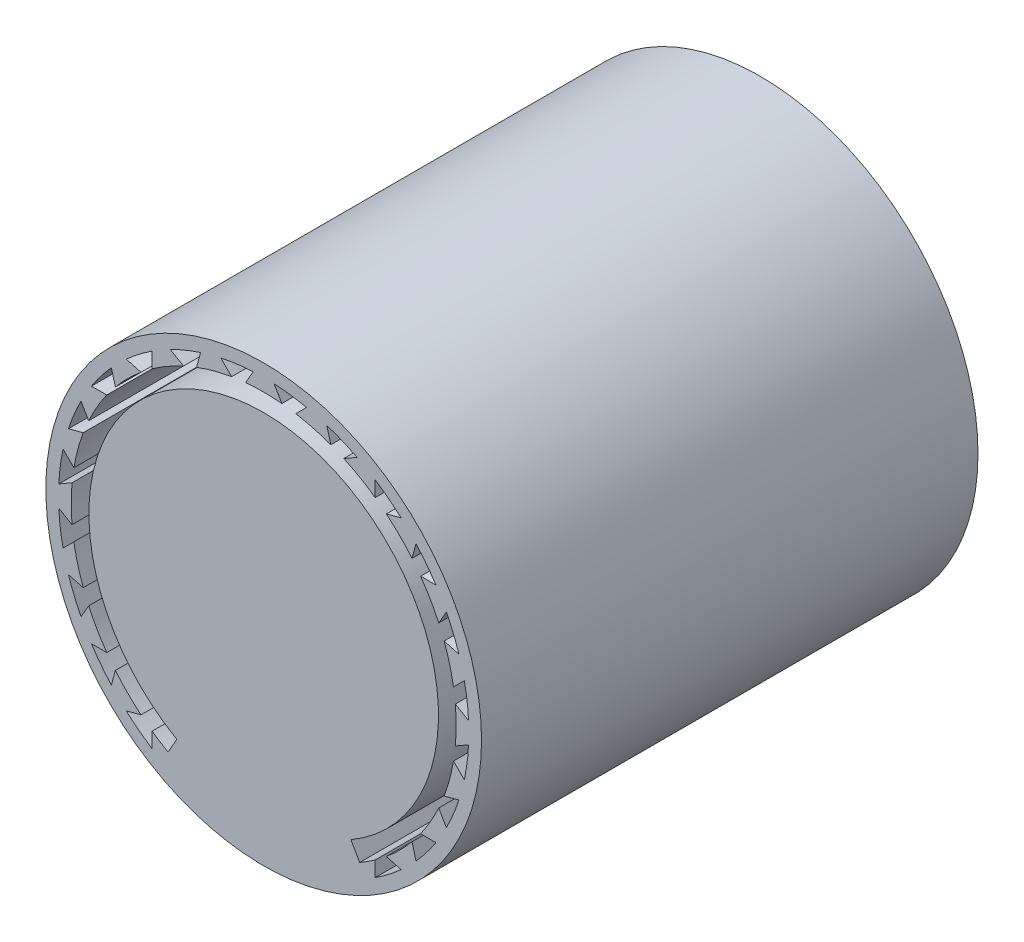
from build123d import *

# Parameters (mm, degrees)
ESQUISSE1_R          = 43
BASE_EXTRUSION_DEPTH = 98


with BuildPart() as part:
    # Esquisse1 → Base-Extrusion (new body)
    with BuildSketch(Plane.XY):
        Circle(ESQUISSE1_R)
        with BuildLine():
            Line((35.61549243, 13.24902634), (38.53335202, 12.467188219))
            ThreePointArc((38.53335202, 12.467188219), (37.417121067, 15.498679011), (36.062827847, 18.431561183))
            Line((36.062827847, 18.431561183), (34.552432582, 15.815479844))
            ThreePointArc((34.552432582, 15.815479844), (32.908965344, 19), (30.972823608, 22.015544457))
            Line((30.972823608, 22.015544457), (33.99361414, 22.015544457))
            ThreePointArc((33.99361414, 22.015544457), (32.130810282, 24.654837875), (30.063577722, 27.137267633))
            Line((30.063577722, 27.137267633), (29.281739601, 24.219408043))
            ThreePointArc((29.281739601, 24.219408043), (26.870057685, 26.870057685), (24.219408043, 29.281739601))
            Line((24.219408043, 29.281739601), (27.137267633, 30.063577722))
            ThreePointArc((27.137267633, 30.063577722), (24.654837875, 32.130810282), (22.015544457, 33.99361414))
            Line((22.015544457, 33.99361414), (22.015544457, 30.972823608))
            ThreePointArc((22.015544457, 30.972823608), (19, 32.908965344), (15.815479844, 34.552432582))
            Line((15.815479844, 34.552432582), (18.431561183, 36.062827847))
            ThreePointArc((18.431561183, 36.062827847), (15.498679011, 37.417121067), (12.467188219, 38.53335202))
            Line((12.467188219, 38.53335202), (13.24902634, 35.61549243))
            ThreePointArc((13.24902634, 35.61549243), (9.835123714, 36.705181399), (6.333752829, 37.468434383))
            Line((6.333752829, 37.468434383), (8.469774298, 39.604455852))
            ThreePointArc((8.469774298, 39.604455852), (5.286310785, 40.153516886), (2.069213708, 40.44710564))
            Line((2.069213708, 40.44710564), (3.579608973, 37.8310243))
            ThreePointArc((3.579608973, 37.8310243), (0, 38), (-3.579608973, 37.8310243))
            Line((-3.579608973, 37.8310243), (-2.069213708, 40.44710564))
            ThreePointArc((-2.069213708, 40.44710564), (-5.286310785, 40.153516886), (-8.469774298, 39.604455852))
            Line((-8.469774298, 39.604455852), (-6.333752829, 37.468434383))
            ThreePointArc((-6.333752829, 37.468434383), (-9.835123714, 36.705181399), (-13.24902634, 35.61549243))
            Line((-13.24902634, 35.61549243), (-12.467188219, 38.53335202))
            ThreePointArc((-12.467188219, 38.53335202), (-15.498679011, 37.417121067), (-18.431561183, 36.062827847))
            Line((-18.431561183, 36.062827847), (-15.815479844, 34.552432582))
            ThreePointArc((-15.815479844, 34.552432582), (-19, 32.908965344), (-22.015544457, 30.972823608))
            Line((-22.015544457, 30.972823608), (-22.015544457, 33.99361414))
            ThreePointArc((-22.015544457, 33.99361414), (-24.654837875, 32.130810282), (-27.137267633, 30.063577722))
            Line((-27.137267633, 30.063577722), (-24.219408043, 29.281739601))
            ThreePointArc((-24.219408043, 29.281739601), (-26.870057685, 26.870057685), (-29.281739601, 24.219408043))
            Line((-29.281739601, 24.219408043), (-30.063577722, 27.137267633))
            ThreePointArc((-30.063577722, 27.137267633), (-32.130810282, 24.654837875), (-33.99361414, 22.015544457))
            Line((-33.99361414, 22.015544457), (-30.972823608, 22.015544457))
            ThreePointArc((-30.972823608, 22.015544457), (-32.908965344, 19), (-34.552432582, 15.815479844))
            Line((-34.552432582, 15.815479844), (-36.062827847, 18.431561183))
            ThreePointArc((-36.062827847, 18.431561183), (-37.417121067, 15.498679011), (-38.53335202, 12.467188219))
            Line((-38.53335202, 12.467188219), (-35.61549243, 13.24902634))
            ThreePointArc((-35.61549243, 13.24902634), (-36.705181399, 9.835123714), (-37.468434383, 6.333752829))
            Line((-37.468434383, 6.333752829), (-39.604455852, 8.469774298))
            ThreePointArc((-39.604455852, 8.469774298), (-40.153516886, 5.286310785), (-40.44710564, 2.069213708))
            Line((-40.44710564, 2.069213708), (-37.8310243, 3.579608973))
            ThreePointArc((-37.8310243, 3.579608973), (-38, 0), (-37.8310243, -3.579608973))
            Line((-37.8310243, -3.579608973), (-40.44710564, -2.069213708))
            ThreePointArc((-40.44710564, -2.069213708), (-40.153516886, -5.286310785), (-39.604455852, -8.469774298))
            Line((-39.604455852, -8.469774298), (-37.468434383, -6.333752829))
            ThreePointArc((-37.468434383, -6.333752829), (-36.705181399, -9.835123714), (-35.61549243, -13.24902634))
            Line((-35.61549243, -13.24902634), (-38.53335202, -12.467188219))
            ThreePointArc((-38.53335202, -12.467188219), (-37.417121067, -15.498679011), (-36.062827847, -18.431561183))
            Line((-36.062827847, -18.431561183), (-34.552432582, -15.815479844))
            ThreePointArc((-34.552432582, -15.815479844), (-32.908965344, -19), (-30.972823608, -22.015544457))
            Line((-30.972823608, -22.015544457), (-33.99361414, -22.015544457))
            ThreePointArc((-33.99361414, -22.015544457), (-32.130810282, -24.654837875), (-30.063577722, -27.137267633))
            Line((-30.063577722, -27.137267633), (-29.281739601, -24.219408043))
            ThreePointArc((-29.281739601, -24.219408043), (-26.870057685, -26.870057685), (-24.219408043, -29.281739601))
            Line((-24.219408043, -29.281739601), (-27.137267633, -30.063577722))
            ThreePointArc((-27.137267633, -30.063577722), (-24.654837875, -32.130810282), (-22.015544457, -33.99361414))
            Line((-22.015544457, -33.99361414), (-22.015544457, -30.972823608))
            ThreePointArc((-22.015544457, -30.972823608), (-20.474739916, -32.012263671), (-18.884953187, -32.975120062))
            Line((-18.884953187, -32.975120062), (-17.145549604, -29.937937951))
            ThreePointArc((-17.145549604, -29.937937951), (-0.035941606, 34.499981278), (17.207890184, -29.90214901))
            Line((17.207890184, -29.90214901), (18.953618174, -32.935700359))
            ThreePointArc((18.953618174, -32.935700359), (20.508078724, -31.990916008), (22.015544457, -30.972823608))
            Line((22.015544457, -30.972823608), (22.015544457, -33.99361414))
            ThreePointArc((22.015544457, -33.99361414), (24.654837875, -32.130810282), (27.137267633, -30.063577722))
            Line((27.137267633, -30.063577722), (24.219408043, -29.281739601))
            ThreePointArc((24.219408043, -29.281739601), (26.870057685, -26.870057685), (29.281739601, -24.219408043))
            Line((29.281739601, -24.219408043), (30.063577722, -27.137267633))
            ThreePointArc((30.063577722, -27.137267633), (32.130810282, -24.654837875), (33.99361414, -22.015544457))
            Line((33.99361414, -22.015544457), (30.972823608, -22.015544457))
            ThreePointArc((30.972823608, -22.015544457), (32.908965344, -19), (34.552432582, -15.815479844))
            Line((34.552432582, -15.815479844), (36.062827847, -18.431561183))
            ThreePointArc((36.062827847, -18.431561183), (37.417121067, -15.498679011), (38.53335202, -12.467188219))
            Line((38.53335202, -12.467188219), (35.61549243, -13.24902634))
            ThreePointArc((35.61549243, -13.24902634), (36.705181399, -9.835123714), (37.468434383, -6.333752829))
            Line((37.468434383, -6.333752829), (39.604455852, -8.469774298))
            ThreePointArc((39.604455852, -8.469774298), (40.153516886, -5.286310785), (40.44710564, -2.069213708))
            Line((40.44710564, -2.069213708), (37.8310243, -3.579608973))
            ThreePointArc((37.8310243, -3.579608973), (38, 0), (37.8310243, 3.579608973))
            Line((37.8310243, 3.579608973), (40.44710564, 2.069213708))
            ThreePointArc((40.44710564, 2.069213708), (40.153516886, 5.286310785), (39.604455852, 8.469774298))
            Line((39.604455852, 8.469774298), (37.468434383, 6.333752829))
            ThreePointArc((37.468434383, 6.333752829), (36.705181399, 9.835123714), (35.61549243, 13.24902634))
        make_face(mode=Mode.SUBTRACT)
    extrude(amount=-BASE_EXTRUSION_DEPTH)


solid = part.part
